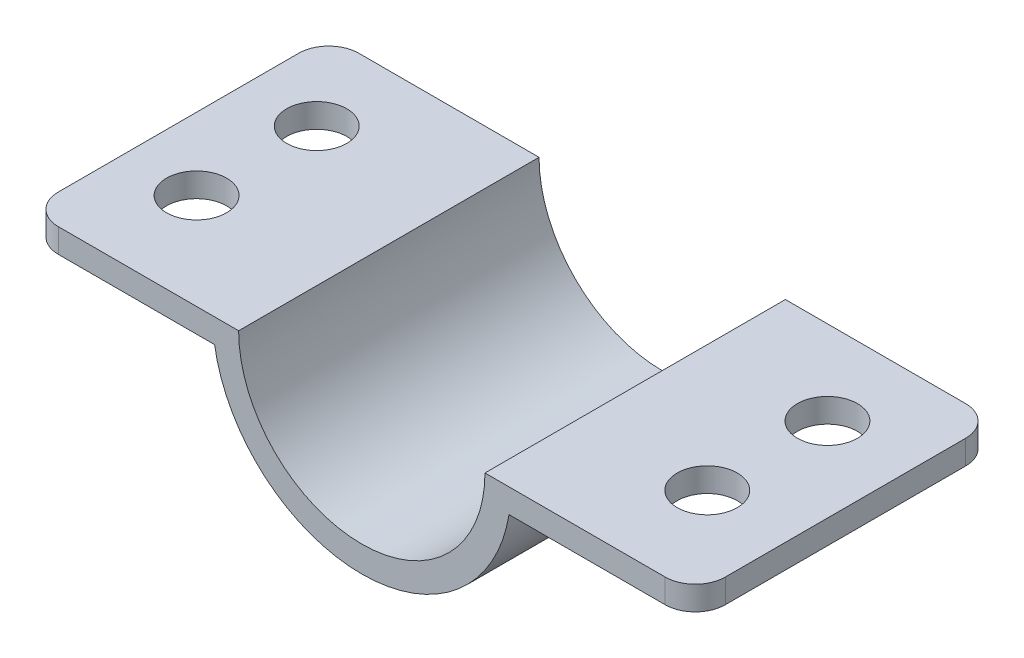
from build123d import *

# Parameters (mm, degrees)
BOSS_EXTRUDE1_DEPTH = 12.5
LPATTERN1_COUNT     = 2
LPATTERN1_PITCH     = 10
LPATTERN2_COUNT     = 2
LPATTERN2_PITCH     = 10
FILLET1_R           = 2.5


with BuildPart() as part:
    # Sketch1 → Boss-Extrude1 (new, symmetric)
    with BuildSketch(Plane.XY):
        with BuildLine():
            Line((-27.75, 0), (-10.25, 0))
            ThreePointArc((-10.25, 0), (0, -10.25), (10.25, 0))
            Line((10.25, 0), (27.75, 0))
            Line((27.75, 0), (27.75, -2))
            Line((27.75, -2), (12.25, -2))
            ThreePointArc((12.25, -2), (0, -12.412191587), (-12.25, -2))
            Line((-12.25, -2), (-27.75, -2))
            Line((-27.75, -2), (-27.75, 0))
        make_face()
    extrude(amount=BOSS_EXTRUDE1_DEPTH, both=True)

    # Sketch13 → 5.0 _5_ Diameter Hole2 (revolve, cut)
    with BuildSketch(Plane(origin=(-21.75, 0, -5.5), x_dir=(0, 0, 1), z_dir=(1, 0, 0))):
        Polygon((0, 0), (0, 11.502151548), (2.5, 10), (2.5, 0), align=None)
    f_5_0_5_diameter_hole2 = revolve(axis=Axis((-21.75, 6.35, -5.5), (0, -1, 0)), mode=Mode.SUBTRACT)

    # LPattern1: 5.0 _5_ Diameter Hole2 ×2
    with Locations(*[(0, 0, i * LPATTERN1_PITCH) for i in range(1, LPATTERN1_COUNT)]):
        add(f_5_0_5_diameter_hole2, mode=Mode.SUBTRACT)

    # Sketch17 → 5.0 _5_ Diameter Hole3 (revolve, cut)
    with BuildSketch(Plane(origin=(20.75, 0, -5.5), x_dir=(0, 0, 1), z_dir=(1, 0, 0))):
        Polygon((0, 0), (0, 11.502151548), (2.5, 10), (2.5, 0), align=None)
    f_5_0_5_diameter_hole3 = revolve(axis=Axis((20.75, 6.35, -5.5), (0, -1, 0)), mode=Mode.SUBTRACT)

    # LPattern2: 5.0 _5_ Diameter Hole3 ×2
    with Locations(*[(0, 0, i * LPATTERN2_PITCH) for i in range(1, LPATTERN2_COUNT)]):
        add(f_5_0_5_diameter_hole3, mode=Mode.SUBTRACT)

    # Fillet1
    fillet1_edges = [part.edges().sort_by_distance(p)[0] for p in [
        (-27.75, -1, -12.5),
        (27.75, -1, 12.5),
        (-27.75, -1, 12.5),
        (27.75, -1, -12.5),
    ]]
    fillet(fillet1_edges, radius=FILLET1_R)


solid = part.part
